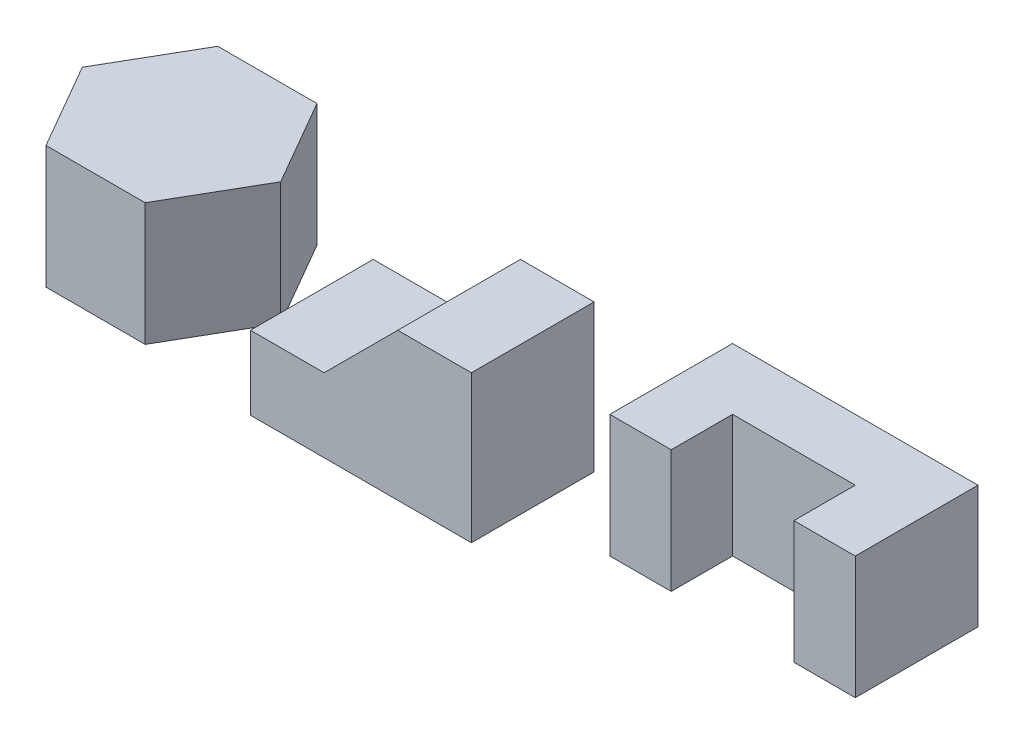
from build123d import *

# Parameters (mm, degrees)
EXTRUDE_1_DEPTH   = 10
EXTRUDE_1_2_DEPTH = 10
EXTRUDE_2_DEPTH   = 10


with BuildPart() as part:
    # Sketch 1 → Extrude 1 (new body)
    with BuildSketch(Plane(origin=(0, 0, 0), x_dir=(1, 0, 0), z_dir=(0, 1, 0))):
        Polygon((8.082903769, 0), (4.041451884, 7), (-4.041451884, 7), (-8.082903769, 0), (-4.041451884, -7), (4.041451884, -7), align=None)
    extrude(amount=EXTRUDE_1_DEPTH)


with BuildPart() as body_2:
    # Sketch 1 → Extrude 1 2 (new body)
    with BuildSketch(Plane(origin=(0, 0, 0), x_dir=(1, 0, 0), z_dir=(0, 1, 0))):
        Polygon((57.906614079, 7), (37.906614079, 7), (37.906614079, -3), (42.906614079, -3), (42.906614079, 2), (52.906614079, 2), (52.906614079, -3), (57.906614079, -3), align=None)
    extrude(amount=EXTRUDE_1_2_DEPTH)


with BuildPart() as body_3:
    # Sketch 2 → Extrude 2 (new body)
    with BuildSketch(Plane.XY):
        Polygon((15.621873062, 8.29106989), (15.621873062, 2.29106989), (33.621873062, 2.29106989), (33.621873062, 14.29106989), (27.621873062, 14.29106989), (21.621873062, 8.29106989), align=None)
    extrude(amount=EXTRUDE_2_DEPTH)


solid = Compound([part.part, body_2.part, body_3.part])
